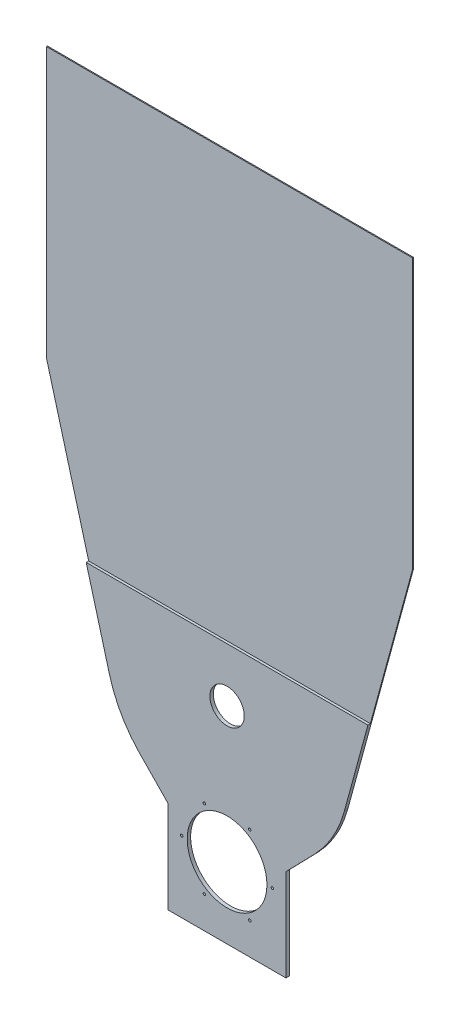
from build123d import *

# Parameters (mm, degrees)
SKETCH1_R           = 162.5
SKETCH1_R_2         = 70
BOSS_EXTRUDE1_DEPTH = 14
M12_TAPPED_HOLE1_D  = 10.2
CIRPATTERN1_COUNT   = 6
CUT_EXTRUDE1_DEPTH  = 10


with BuildPart() as part:
    # Sketch1 → Boss-Extrude1 (new body)
    with BuildSketch(Plane.XY):
        with BuildLine():
            Line((-240, 85.414585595), (-359.378262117, 208.147305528))
            ThreePointArc((-359.378262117, 208.147305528), (-432.064547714, 306.409715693), (-478.514634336, 419.463626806))
            Line((-478.514634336, 419.463626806), (-746, 1400))
            Line((-746, 1400), (-746, 2500))
            Line((-746, 2500), (746, 2500))
            Line((746, 2500), (746, 1400))
            Line((746, 1400), (478.514634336, 419.463626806))
            ThreePointArc((478.514634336, 419.463626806), (432.064547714, 306.409715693), (359.378262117, 208.147305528))
            Line((359.378262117, 208.147305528), (240, 85.414585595))
            Line((240, 85.414585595), (240, -290))
            Line((240, -290), (-240, -290))
            Line((-240, -290), (-240, 85.414585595))
        make_face()
        Circle(SKETCH1_R, mode=Mode.SUBTRACT)
        with Locations((0, 550)):
            Circle(SKETCH1_R_2, mode=Mode.SUBTRACT)
    extrude(amount=BOSS_EXTRUDE1_DEPTH)

    # M12 Tapped Hole1 (through all)
    with Locations(Plane(origin=(0, 0, 0), x_dir=(-1, 0, 0), z_dir=(0, 0, -1))):
        with Locations((185, 0)):
            m12_tapped_hole1 = Hole(M12_TAPPED_HOLE1_D / 2)

    # CirPattern1: M12 Tapped Hole1 ×6 about axis
    cirpattern1_axis = Axis((0, 0, 0), (0, 0, 1))
    for i in range(1, CIRPATTERN1_COUNT):
        add(m12_tapped_hole1.rotate(cirpattern1_axis, i * 360 / CIRPATTERN1_COUNT), mode=Mode.SUBTRACT)

    # Sketch5 → Cut-Extrude1 (cut)
    with BuildSketch(Plane(origin=(0, 0, 14), x_dir=(-1, 0, 0), z_dir=(0, 0, -1))):
        Polygon((-746, 2500), (746, 2500), (746, 1400), (574.139184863, 770), (-574.139184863, 770), (-746, 1400), align=None)
    extrude(amount=CUT_EXTRUDE1_DEPTH, mode=Mode.SUBTRACT)


solid = part.part
